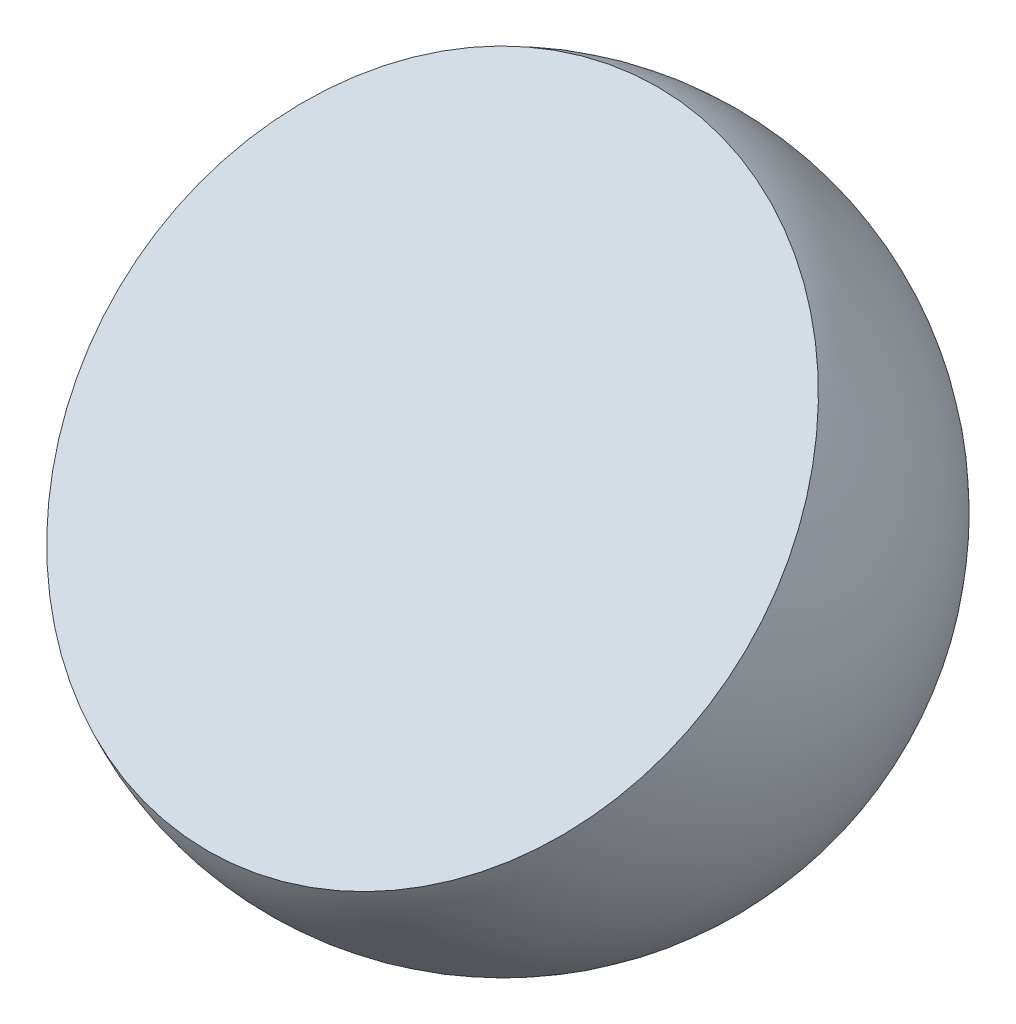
from build123d import *

# Parameters (mm, degrees)
CUT_EXTRUDE_1_DEPTH      = 52.961524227
CUT_EXTRUDE_1_DEPTH_BACK = 52.961524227


with BuildPart() as part:
    # Sketch 1 → Revolve 3 (revolve)
    with BuildSketch(Plane(origin=(0, 0, 0), x_dir=(0, 0, -1), z_dir=(1, 0, 0))):
        with BuildLine():
            Line((0, 30), (0, -30))
            ThreePointArc((0, -30), (30, 0), (0, 30))
        make_face()
    revolve(axis=Axis((0, 47.180196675, 0), (0, -1, 0)))

    # Sketch 2 → Cut-Extrude 1 (cut, two sides: drawn at the far end of the back side and taken through both)
    with BuildSketch(Plane(origin=(0, 0, 0), x_dir=(0, 0, -1), z_dir=(1, 0, 0)).offset(-CUT_EXTRUDE_1_DEPTH_BACK)):
        Polygon((21.649697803, 33.901189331), (-32.455591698, -18.66263893), (-40.471190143, 35.905088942), align=None)
    extrude(amount=CUT_EXTRUDE_1_DEPTH + CUT_EXTRUDE_1_DEPTH_BACK, mode=Mode.SUBTRACT)


solid = part.part
